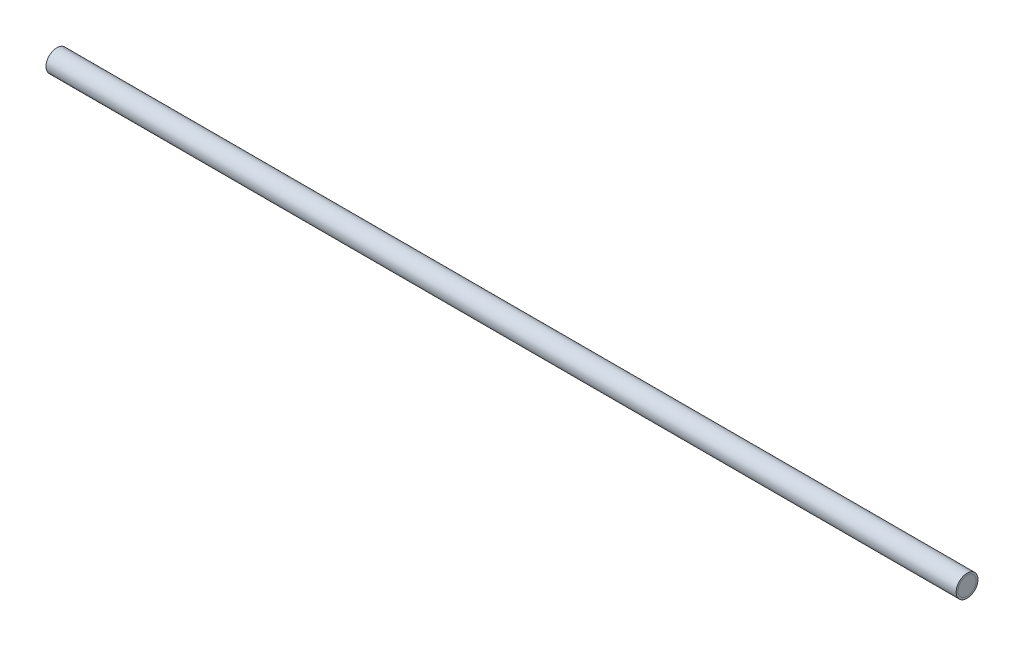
ISO-10303-21;
HEADER;
FILE_DESCRIPTION(('STEP AP214'),'2;1');
FILE_NAME('part.step','',(''),(''),'','','');
FILE_SCHEMA(('AUTOMOTIVE_DESIGN { 1 0 10303 214 1 1 1 1 }'));
ENDSEC;
DATA;
#1=APPLICATION_CONTEXT('core data for automotive mechanical design processes');
#2=APPLICATION_PROTOCOL_DEFINITION('international standard','automotive_design',2000,#1);
#3=PRODUCT_CONTEXT('',#1,'mechanical');
#4=PRODUCT('Part','Part','',(#3));
#5=PRODUCT_RELATED_PRODUCT_CATEGORY('part','',(#4));
#6=PRODUCT_DEFINITION_FORMATION('','',#4);
#7=PRODUCT_DEFINITION_CONTEXT('part definition',#1,'design');
#8=PRODUCT_DEFINITION('design','',#6,#7);
#9=PRODUCT_DEFINITION_SHAPE('','',#8);
#10=(LENGTH_UNIT() NAMED_UNIT(*) SI_UNIT(.MILLI.,.METRE.));
#11=(NAMED_UNIT(*) PLANE_ANGLE_UNIT() SI_UNIT($,.RADIAN.));
#12=(NAMED_UNIT(*) SI_UNIT($,.STERADIAN.) SOLID_ANGLE_UNIT());
#13=UNCERTAINTY_MEASURE_WITH_UNIT(LENGTH_MEASURE(1.E-05),#10,'distance_accuracy_value','');
#14=(GEOMETRIC_REPRESENTATION_CONTEXT(3) GLOBAL_UNCERTAINTY_ASSIGNED_CONTEXT((#13)) GLOBAL_UNIT_ASSIGNED_CONTEXT((#10,
#11,#12)) REPRESENTATION_CONTEXT('',''));
#15=CARTESIAN_POINT('',(0.,0.,0.));
#16=DIRECTION('',(0.,0.,1.));
#17=DIRECTION('',(1.,0.,0.));
#18=AXIS2_PLACEMENT_3D('',#15,#16,#17);
#19=CARTESIAN_POINT('',(10000.,0.,0.));
#20=DIRECTION('',(1.,0.,0.));
#21=DIRECTION('',(0.,0.,-1.));
#22=AXIS2_PLACEMENT_3D('',#19,#20,#21);
#23=PLANE('',#22);
#24=CARTESIAN_POINT('',(10000.,0.,0.));
#25=DIRECTION('',(1.,0.,0.));
#26=DIRECTION('',(0.,0.,-1.));
#27=AXIS2_PLACEMENT_3D('',#24,#25,#26);
#28=CIRCLE('',#27,120.);
#29=CARTESIAN_POINT('',(10000.,0.,-120.));
#30=VERTEX_POINT('',#29);
#31=EDGE_CURVE('P0_E10',#30,#30,#28,.T.);
#32=ORIENTED_EDGE('',*,*,#31,.T.);
#33=EDGE_LOOP('',(#32));
#34=FACE_BOUND('',#33,.T.);
#35=CARTESIAN_POINT('',(10000.,0.,0.));
#36=DIRECTION('',(1.,0.,0.));
#37=DIRECTION('',(0.,0.,-1.));
#38=AXIS2_PLACEMENT_3D('',#35,#36,#37);
#39=CIRCLE('',#38,100.);
#40=CARTESIAN_POINT('',(10000.,0.,-100.));
#41=VERTEX_POINT('',#40);
#42=EDGE_CURVE('P0_E43',#41,#41,#39,.T.);
#43=ORIENTED_EDGE('',*,*,#42,.F.);
#44=EDGE_LOOP('',(#43));
#45=FACE_BOUND('',#44,.T.);
#46=ADVANCED_FACE('P0_F32',(#34,#45),#23,.T.);
#47=CARTESIAN_POINT('',(0.,0.,0.));
#48=DIRECTION('',(1.,0.,0.));
#49=DIRECTION('',(0.,0.,-1.));
#50=AXIS2_PLACEMENT_3D('',#47,#48,#49);
#51=PLANE('',#50);
#52=CARTESIAN_POINT('',(0.,0.,0.));
#53=DIRECTION('',(1.,0.,0.));
#54=DIRECTION('',(0.,0.,-1.));
#55=AXIS2_PLACEMENT_3D('',#52,#53,#54);
#56=CIRCLE('',#55,120.);
#57=CARTESIAN_POINT('',(0.,0.,-120.));
#58=VERTEX_POINT('',#57);
#59=EDGE_CURVE('P0_E36',#58,#58,#56,.T.);
#60=ORIENTED_EDGE('',*,*,#59,.F.);
#61=EDGE_LOOP('',(#60));
#62=FACE_BOUND('',#61,.T.);
#63=CARTESIAN_POINT('',(0.,0.,0.));
#64=DIRECTION('',(1.,0.,0.));
#65=DIRECTION('',(0.,0.,-1.));
#66=AXIS2_PLACEMENT_3D('',#63,#64,#65);
#67=CIRCLE('',#66,100.);
#68=CARTESIAN_POINT('',(0.,0.,-100.));
#69=VERTEX_POINT('',#68);
#70=EDGE_CURVE('P0_E45',#69,#69,#67,.T.);
#71=ORIENTED_EDGE('',*,*,#70,.T.);
#72=EDGE_LOOP('',(#71));
#73=FACE_BOUND('',#72,.T.);
#74=ADVANCED_FACE('P0_F55',(#62,#73),#51,.F.);
#75=CARTESIAN_POINT('',(10000.,0.,0.));
#76=DIRECTION('',(-1.,0.,0.));
#77=DIRECTION('',(0.,0.,1.));
#78=AXIS2_PLACEMENT_3D('',#75,#76,#77);
#79=CYLINDRICAL_SURFACE('',#78,120.);
#80=ORIENTED_EDGE('',*,*,#31,.F.);
#81=EDGE_LOOP('',(#80));
#82=FACE_BOUND('',#81,.T.);
#83=ORIENTED_EDGE('',*,*,#59,.T.);
#84=EDGE_LOOP('',(#83));
#85=FACE_BOUND('',#84,.T.);
#86=ADVANCED_FACE('P0_F34',(#82,#85),#79,.T.);
#87=CARTESIAN_POINT('',(10000.,0.,0.));
#88=DIRECTION('',(-1.,0.,0.));
#89=DIRECTION('',(0.,0.,1.));
#90=AXIS2_PLACEMENT_3D('',#87,#88,#89);
#91=CYLINDRICAL_SURFACE('',#90,100.);
#92=ORIENTED_EDGE('',*,*,#42,.T.);
#93=EDGE_LOOP('',(#92));
#94=FACE_BOUND('',#93,.T.);
#95=ORIENTED_EDGE('',*,*,#70,.F.);
#96=EDGE_LOOP('',(#95));
#97=FACE_BOUND('',#96,.T.);
#98=ADVANCED_FACE('P0_F51',(#94,#97),#91,.F.);
#99=CLOSED_SHELL('',(#46,#74,#86,#98));
#100=MANIFOLD_SOLID_BREP('P0_B2',#99);
#101=CARTESIAN_POINT('',(1.,0.,0.));
#102=DIRECTION('',(-1.,0.,0.));
#103=DIRECTION('',(0.,0.,1.));
#104=AXIS2_PLACEMENT_3D('',#101,#102,#103);
#105=CYLINDRICAL_SURFACE('',#104,100.);
#106=CARTESIAN_POINT('',(1.,0.,0.));
#107=DIRECTION('',(-1.,0.,0.));
#108=DIRECTION('',(0.,0.,1.));
#109=AXIS2_PLACEMENT_3D('',#106,#107,#108);
#110=CIRCLE('',#109,100.);
#111=CARTESIAN_POINT('',(1.,0.,100.));
#112=VERTEX_POINT('',#111);
#113=EDGE_CURVE('P1_E10',#112,#112,#110,.F.);
#114=ORIENTED_EDGE('',*,*,#113,.F.);
#115=EDGE_LOOP('',(#114));
#116=FACE_BOUND('',#115,.T.);
#117=CARTESIAN_POINT('',(0.,0.,0.));
#118=DIRECTION('',(-1.,0.,0.));
#119=DIRECTION('',(0.,0.,1.));
#120=AXIS2_PLACEMENT_3D('',#117,#118,#119);
#121=CIRCLE('',#120,100.);
#122=CARTESIAN_POINT('',(0.,0.,100.));
#123=VERTEX_POINT('',#122);
#124=EDGE_CURVE('P1_E17',#123,#123,#121,.F.);
#125=ORIENTED_EDGE('',*,*,#124,.T.);
#126=EDGE_LOOP('',(#125));
#127=FACE_BOUND('',#126,.T.);
#128=ADVANCED_FACE('P1_F14',(#116,#127),#105,.T.);
#129=CARTESIAN_POINT('',(1.,0.,100.));
#130=DIRECTION('',(-1.,0.,0.));
#131=DIRECTION('',(0.,-1.,0.));
#132=AXIS2_PLACEMENT_3D('',#129,#130,#131);
#133=PLANE('',#132);
#134=ORIENTED_EDGE('',*,*,#113,.T.);
#135=EDGE_LOOP('',(#134));
#136=FACE_BOUND('',#135,.T.);
#137=ADVANCED_FACE('P1_F29',(#136),#133,.F.);
#138=CARTESIAN_POINT('',(0.,0.,100.));
#139=DIRECTION('',(-1.,0.,0.));
#140=DIRECTION('',(0.,-1.,0.));
#141=AXIS2_PLACEMENT_3D('',#138,#139,#140);
#142=PLANE('',#141);
#143=ORIENTED_EDGE('',*,*,#124,.F.);
#144=EDGE_LOOP('',(#143));
#145=FACE_BOUND('',#144,.T.);
#146=ADVANCED_FACE('P1_F27',(#145),#142,.T.);
#147=CLOSED_SHELL('',(#128,#137,#146));
#148=MANIFOLD_SOLID_BREP('P1_B1',#147);
#149=CARTESIAN_POINT('',(9999.,0.,0.));
#150=DIRECTION('',(1.,0.,0.));
#151=DIRECTION('',(0.,0.,-1.));
#152=AXIS2_PLACEMENT_3D('',#149,#150,#151);
#153=CYLINDRICAL_SURFACE('',#152,100.);
#154=CARTESIAN_POINT('',(9999.,0.,0.));
#155=DIRECTION('',(1.,0.,0.));
#156=DIRECTION('',(0.,0.,-1.));
#157=AXIS2_PLACEMENT_3D('',#154,#155,#156);
#158=CIRCLE('',#157,100.);
#159=CARTESIAN_POINT('',(9999.,0.,-100.));
#160=VERTEX_POINT('',#159);
#161=EDGE_CURVE('P2_E10',#160,#160,#158,.F.);
#162=ORIENTED_EDGE('',*,*,#161,.F.);
#163=EDGE_LOOP('',(#162));
#164=FACE_BOUND('',#163,.T.);
#165=CARTESIAN_POINT('',(10000.,0.,0.));
#166=DIRECTION('',(1.,0.,0.));
#167=DIRECTION('',(0.,0.,-1.));
#168=AXIS2_PLACEMENT_3D('',#165,#166,#167);
#169=CIRCLE('',#168,100.);
#170=CARTESIAN_POINT('',(10000.,0.,-100.));
#171=VERTEX_POINT('',#170);
#172=EDGE_CURVE('P2_E17',#171,#171,#169,.F.);
#173=ORIENTED_EDGE('',*,*,#172,.T.);
#174=EDGE_LOOP('',(#173));
#175=FACE_BOUND('',#174,.T.);
#176=ADVANCED_FACE('P2_F14',(#164,#175),#153,.T.);
#177=CARTESIAN_POINT('',(9999.,0.,100.));
#178=DIRECTION('',(1.,0.,0.));
#179=DIRECTION('',(0.,1.,0.));
#180=AXIS2_PLACEMENT_3D('',#177,#178,#179);
#181=PLANE('',#180);
#182=ORIENTED_EDGE('',*,*,#161,.T.);
#183=EDGE_LOOP('',(#182));
#184=FACE_BOUND('',#183,.T.);
#185=ADVANCED_FACE('P2_F29',(#184),#181,.F.);
#186=CARTESIAN_POINT('',(10000.,0.,100.));
#187=DIRECTION('',(1.,0.,0.));
#188=DIRECTION('',(0.,1.,0.));
#189=AXIS2_PLACEMENT_3D('',#186,#187,#188);
#190=PLANE('',#189);
#191=ORIENTED_EDGE('',*,*,#172,.F.);
#192=EDGE_LOOP('',(#191));
#193=FACE_BOUND('',#192,.T.);
#194=ADVANCED_FACE('P2_F27',(#193),#190,.T.);
#195=CLOSED_SHELL('',(#176,#185,#194));
#196=MANIFOLD_SOLID_BREP('P2_B1',#195);
#197=ADVANCED_BREP_SHAPE_REPRESENTATION('',(#18,#100,#148,#196),#14);
#198=SHAPE_DEFINITION_REPRESENTATION(#9,#197);
ENDSEC;
END-ISO-10303-21;
